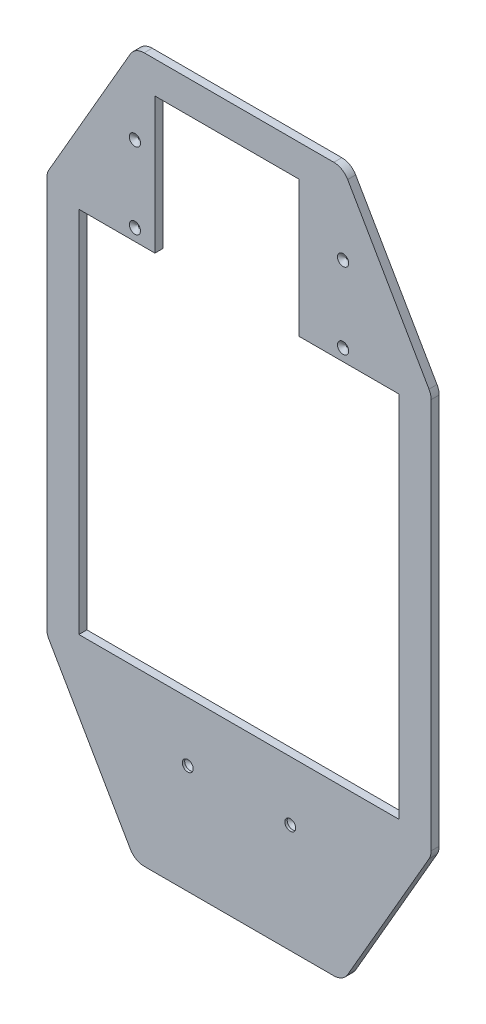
ISO-10303-21;
HEADER;
FILE_DESCRIPTION(('STEP AP214'),'2;1');
FILE_NAME('part.step','',(''),(''),'','','');
FILE_SCHEMA(('AUTOMOTIVE_DESIGN { 1 0 10303 214 1 1 1 1 }'));
ENDSEC;
DATA;
#1=APPLICATION_CONTEXT('core data for automotive mechanical design processes');
#2=APPLICATION_PROTOCOL_DEFINITION('international standard','automotive_design',2000,#1);
#3=PRODUCT_CONTEXT('',#1,'mechanical');
#4=PRODUCT('Part','Part','',(#3));
#5=PRODUCT_RELATED_PRODUCT_CATEGORY('part','',(#4));
#6=PRODUCT_DEFINITION_FORMATION('','',#4);
#7=PRODUCT_DEFINITION_CONTEXT('part definition',#1,'design');
#8=PRODUCT_DEFINITION('design','',#6,#7);
#9=PRODUCT_DEFINITION_SHAPE('','',#8);
#10=(LENGTH_UNIT() NAMED_UNIT(*) SI_UNIT(.MILLI.,.METRE.));
#11=(NAMED_UNIT(*) PLANE_ANGLE_UNIT() SI_UNIT($,.RADIAN.));
#12=(NAMED_UNIT(*) SI_UNIT($,.STERADIAN.) SOLID_ANGLE_UNIT());
#13=UNCERTAINTY_MEASURE_WITH_UNIT(LENGTH_MEASURE(1.E-05),#10,'distance_accuracy_value','');
#14=(GEOMETRIC_REPRESENTATION_CONTEXT(3) GLOBAL_UNCERTAINTY_ASSIGNED_CONTEXT((#13)) GLOBAL_UNIT_ASSIGNED_CONTEXT((#10,
#11,#12)) REPRESENTATION_CONTEXT('',''));
#15=CARTESIAN_POINT('',(0.,0.,0.));
#16=DIRECTION('',(0.,0.,1.));
#17=DIRECTION('',(1.,0.,0.));
#18=AXIS2_PLACEMENT_3D('',#15,#16,#17);
#19=CARTESIAN_POINT('',(0.,0.,4.));
#20=DIRECTION('',(0.,0.,1.));
#21=DIRECTION('',(1.,0.,0.));
#22=AXIS2_PLACEMENT_3D('',#19,#20,#21);
#23=PLANE('',#22);
#24=DIRECTION('',(0.,1.,0.));
#25=VECTOR('',#24,1.);
#26=CARTESIAN_POINT('',(99.9999999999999,116.666666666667,4.));
#27=LINE('',#26,#25);
#28=CARTESIAN_POINT('',(100.,-115.,4.));
#29=VERTEX_POINT('',#28);
#30=CARTESIAN_POINT('',(99.9999999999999,115.,4.));
#31=VERTEX_POINT('',#30);
#32=EDGE_CURVE('E285',#29,#31,#27,.T.);
#33=ORIENTED_EDGE('',*,*,#32,.T.);
#34=DIRECTION('',(-1.,0.,0.));
#35=VECTOR('',#34,1.);
#36=CARTESIAN_POINT('',(-37.5,115.,4.));
#37=LINE('',#36,#35);
#38=CARTESIAN_POINT('',(37.5,115.,4.));
#39=VERTEX_POINT('',#38);
#40=EDGE_CURVE('E291',#31,#39,#37,.T.);
#41=ORIENTED_EDGE('',*,*,#40,.T.);
#42=DIRECTION('',(0.,-1.,0.));
#43=VECTOR('',#42,1.);
#44=CARTESIAN_POINT('',(37.5,200.,4.));
#45=LINE('',#44,#43);
#46=CARTESIAN_POINT('',(37.5,200.,4.));
#47=VERTEX_POINT('',#46);
#48=EDGE_CURVE('E964',#47,#39,#45,.T.);
#49=ORIENTED_EDGE('',*,*,#48,.F.);
#50=DIRECTION('',(-1.,0.,0.));
#51=VECTOR('',#50,1.);
#52=CARTESIAN_POINT('',(47.6609802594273,200.,4.));
#53=LINE('',#52,#51);
#54=CARTESIAN_POINT('',(-52.5,200.,4.));
#55=VERTEX_POINT('',#54);
#56=EDGE_CURVE('E64',#47,#55,#53,.T.);
#57=ORIENTED_EDGE('',*,*,#56,.T.);
#58=DIRECTION('',(0.,1.,0.));
#59=VECTOR('',#58,1.);
#60=CARTESIAN_POINT('',(-52.5,200.,4.));
#61=LINE('',#60,#59);
#62=CARTESIAN_POINT('',(-52.5,115.,4.));
#63=VERTEX_POINT('',#62);
#64=EDGE_CURVE('E958',#63,#55,#61,.T.);
#65=ORIENTED_EDGE('',*,*,#64,.F.);
#66=CARTESIAN_POINT('',(-100.,115.,4.));
#67=VERTEX_POINT('',#66);
#68=EDGE_CURVE('E297',#63,#67,#37,.T.);
#69=ORIENTED_EDGE('',*,*,#68,.T.);
#70=DIRECTION('',(0.,-1.,0.));
#71=VECTOR('',#70,1.);
#72=CARTESIAN_POINT('',(-100.,116.666666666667,4.));
#73=LINE('',#72,#71);
#74=CARTESIAN_POINT('',(-100.,-115.,4.));
#75=VERTEX_POINT('',#74);
#76=EDGE_CURVE('E952',#67,#75,#73,.T.);
#77=ORIENTED_EDGE('',*,*,#76,.T.);
#78=DIRECTION('',(-1.,0.,0.));
#79=VECTOR('',#78,1.);
#80=CARTESIAN_POINT('',(-37.5,-115.,4.));
#81=LINE('',#80,#79);
#82=EDGE_CURVE('E295',#29,#75,#81,.T.);
#83=ORIENTED_EDGE('',*,*,#82,.F.);
#84=EDGE_LOOP('',(#33,#41,#49,#57,#65,#69,#77,#83));
#85=FACE_BOUND('',#84,.T.);
#86=DIRECTION('',(-0.499999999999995,-0.866025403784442,0.));
#87=VECTOR('',#86,1.);
#88=CARTESIAN_POINT('',(77.1058439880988,-199.,4.));
#89=LINE('',#88,#87);
#90=CARTESIAN_POINT('',(118.660254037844,-127.025650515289,4.));
#91=VERTEX_POINT('',#90);
#92=CARTESIAN_POINT('',(67.8682396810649,-215.,4.));
#93=VERTEX_POINT('',#92);
#94=EDGE_CURVE('E261',#91,#93,#89,.T.);
#95=ORIENTED_EDGE('',*,*,#94,.T.);
#96=CARTESIAN_POINT('',(59.2079856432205,-210.,4.));
#97=DIRECTION('',(0.,0.,1.));
#98=DIRECTION('',(1.,0.,0.));
#99=AXIS2_PLACEMENT_3D('',#96,#97,#98);
#100=CIRCLE('',#99,10.);
#101=CARTESIAN_POINT('',(59.2079856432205,-220.,4.));
#102=VERTEX_POINT('',#101);
#103=EDGE_CURVE('E13',#102,#93,#100,.T.);
#104=ORIENTED_EDGE('',*,*,#103,.F.);
#105=DIRECTION('',(1.,0.,0.));
#106=VECTOR('',#105,1.);
#107=CARTESIAN_POINT('',(0.,-220.,4.));
#108=LINE('',#107,#106);
#109=CARTESIAN_POINT('',(-59.2079856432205,-220.,4.));
#110=VERTEX_POINT('',#109);
#111=EDGE_CURVE('E49',#110,#102,#108,.T.);
#112=ORIENTED_EDGE('',*,*,#111,.F.);
#113=CARTESIAN_POINT('',(-59.2079856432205,-210.,4.));
#114=DIRECTION('',(0.,0.,1.));
#115=DIRECTION('',(1.,0.,0.));
#116=AXIS2_PLACEMENT_3D('',#113,#114,#115);
#117=CIRCLE('',#116,10.);
#118=CARTESIAN_POINT('',(-67.8682396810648,-215.,4.));
#119=VERTEX_POINT('',#118);
#120=EDGE_CURVE('E244',#119,#110,#117,.T.);
#121=ORIENTED_EDGE('',*,*,#120,.F.);
#122=DIRECTION('',(-0.499999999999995,0.866025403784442,0.));
#123=VECTOR('',#122,1.);
#124=CARTESIAN_POINT('',(-77.1058439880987,-199.,4.));
#125=LINE('',#124,#123);
#126=CARTESIAN_POINT('',(-118.660254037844,-127.025650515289,4.));
#127=VERTEX_POINT('',#126);
#128=EDGE_CURVE('E377',#119,#127,#125,.T.);
#129=ORIENTED_EDGE('',*,*,#128,.T.);
#130=CARTESIAN_POINT('',(-110.,-122.025650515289,4.));
#131=DIRECTION('',(0.,0.,-1.));
#132=DIRECTION('',(-1.,0.,0.));
#133=AXIS2_PLACEMENT_3D('',#130,#131,#132);
#134=CIRCLE('',#133,9.99999999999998);
#135=CARTESIAN_POINT('',(-120.,-122.025650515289,4.));
#136=VERTEX_POINT('',#135);
#137=EDGE_CURVE('E379',#127,#136,#134,.T.);
#138=ORIENTED_EDGE('',*,*,#137,.T.);
#139=DIRECTION('',(0.,1.,0.));
#140=VECTOR('',#139,1.);
#141=CARTESIAN_POINT('',(-120.,-122.025650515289,4.));
#142=LINE('',#141,#140);
#143=CARTESIAN_POINT('',(-120.,122.025650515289,4.));
#144=VERTEX_POINT('',#143);
#145=EDGE_CURVE('E381',#136,#144,#142,.T.);
#146=ORIENTED_EDGE('',*,*,#145,.T.);
#147=CARTESIAN_POINT('',(-110.,122.025650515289,4.));
#148=DIRECTION('',(0.,0.,-1.));
#149=DIRECTION('',(-1.,0.,0.));
#150=AXIS2_PLACEMENT_3D('',#147,#148,#149);
#151=CIRCLE('',#150,10.);
#152=CARTESIAN_POINT('',(-118.660254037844,127.025650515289,4.));
#153=VERTEX_POINT('',#152);
#154=EDGE_CURVE('E374',#144,#153,#151,.T.);
#155=ORIENTED_EDGE('',*,*,#154,.T.);
#156=DIRECTION('',(0.500000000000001,0.866025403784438,0.));
#157=VECTOR('',#156,1.);
#158=CARTESIAN_POINT('',(-118.660254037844,127.025650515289,4.));
#159=LINE('',#158,#157);
#160=CARTESIAN_POINT('',(-67.8682396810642,215.,4.));
#161=VERTEX_POINT('',#160);
#162=EDGE_CURVE('E241',#153,#161,#159,.T.);
#163=ORIENTED_EDGE('',*,*,#162,.T.);
#164=CARTESIAN_POINT('',(-59.2079856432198,210.,4.));
#165=DIRECTION('',(0.,0.,1.));
#166=DIRECTION('',(1.,0.,0.));
#167=AXIS2_PLACEMENT_3D('',#164,#165,#166);
#168=CIRCLE('',#167,10.);
#169=CARTESIAN_POINT('',(-59.2079856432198,220.,4.));
#170=VERTEX_POINT('',#169);
#171=EDGE_CURVE('E227',#170,#161,#168,.T.);
#172=ORIENTED_EDGE('',*,*,#171,.F.);
#173=DIRECTION('',(-1.,0.,0.));
#174=VECTOR('',#173,1.);
#175=CARTESIAN_POINT('',(0.,220.,4.));
#176=LINE('',#175,#174);
#177=CARTESIAN_POINT('',(59.2079856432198,220.,4.));
#178=VERTEX_POINT('',#177);
#179=EDGE_CURVE('E232',#178,#170,#176,.T.);
#180=ORIENTED_EDGE('',*,*,#179,.F.);
#181=CARTESIAN_POINT('',(59.2079856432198,210.,4.));
#182=DIRECTION('',(0.,0.,1.));
#183=DIRECTION('',(1.,0.,0.));
#184=AXIS2_PLACEMENT_3D('',#181,#182,#183);
#185=CIRCLE('',#184,10.);
#186=CARTESIAN_POINT('',(67.8682396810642,215.,4.));
#187=VERTEX_POINT('',#186);
#188=EDGE_CURVE('E242',#187,#178,#185,.T.);
#189=ORIENTED_EDGE('',*,*,#188,.F.);
#190=DIRECTION('',(0.500000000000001,-0.866025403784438,0.));
#191=VECTOR('',#190,1.);
#192=CARTESIAN_POINT('',(118.660254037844,127.025650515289,4.));
#193=LINE('',#192,#191);
#194=CARTESIAN_POINT('',(118.660254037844,127.025650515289,4.));
#195=VERTEX_POINT('',#194);
#196=EDGE_CURVE('E383',#187,#195,#193,.T.);
#197=ORIENTED_EDGE('',*,*,#196,.T.);
#198=CARTESIAN_POINT('',(110.,122.025650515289,4.));
#199=DIRECTION('',(0.,0.,-1.));
#200=DIRECTION('',(1.,0.,0.));
#201=AXIS2_PLACEMENT_3D('',#198,#199,#200);
#202=CIRCLE('',#201,9.99999999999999);
#203=CARTESIAN_POINT('',(120.,122.025650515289,4.));
#204=VERTEX_POINT('',#203);
#205=EDGE_CURVE('E385',#195,#204,#202,.T.);
#206=ORIENTED_EDGE('',*,*,#205,.T.);
#207=DIRECTION('',(0.,-1.,0.));
#208=VECTOR('',#207,1.);
#209=CARTESIAN_POINT('',(120.,-122.025650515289,4.));
#210=LINE('',#209,#208);
#211=CARTESIAN_POINT('',(120.,-122.025650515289,4.));
#212=VERTEX_POINT('',#211);
#213=EDGE_CURVE('E387',#204,#212,#210,.T.);
#214=ORIENTED_EDGE('',*,*,#213,.T.);
#215=CARTESIAN_POINT('',(110.,-122.025650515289,4.));
#216=DIRECTION('',(0.,0.,-1.));
#217=DIRECTION('',(1.,0.,0.));
#218=AXIS2_PLACEMENT_3D('',#215,#216,#217);
#219=CIRCLE('',#218,9.99999999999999);
#220=EDGE_CURVE('E389',#212,#91,#219,.T.);
#221=ORIENTED_EDGE('',*,*,#220,.T.);
#222=EDGE_LOOP('',(#95,#104,#112,#121,#129,#138,#146,#155,#163,#172,#180,#189,#197,#206,#214,#221));
#223=FACE_BOUND('',#222,.T.);
#224=ADVANCED_FACE('F41',(#85,#223),#23,.F.);
#225=CARTESIAN_POINT('',(-37.5,115.,-10.));
#226=DIRECTION('',(0.,-1.,0.));
#227=DIRECTION('',(0.,0.,-1.));
#228=AXIS2_PLACEMENT_3D('',#225,#226,#227);
#229=PLANE('',#228);
#230=ORIENTED_EDGE('',*,*,#40,.F.);
#231=DIRECTION('',(0.,0.,1.));
#232=VECTOR('',#231,1.);
#233=CARTESIAN_POINT('',(100.,115.,-10.));
#234=LINE('',#233,#232);
#235=CARTESIAN_POINT('',(99.9999999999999,115.,9.));
#236=VERTEX_POINT('',#235);
#237=EDGE_CURVE('E395',#31,#236,#234,.T.);
#238=ORIENTED_EDGE('',*,*,#237,.T.);
#239=DIRECTION('',(-1.,0.,0.));
#240=VECTOR('',#239,1.);
#241=CARTESIAN_POINT('',(-37.5,115.,9.));
#242=LINE('',#241,#240);
#243=CARTESIAN_POINT('',(37.5,115.,9.));
#244=VERTEX_POINT('',#243);
#245=EDGE_CURVE('E307',#236,#244,#242,.T.);
#246=ORIENTED_EDGE('',*,*,#245,.T.);
#247=DIRECTION('',(0.,0.,1.));
#248=VECTOR('',#247,1.);
#249=CARTESIAN_POINT('',(37.5,115.,-10.));
#250=LINE('',#249,#248);
#251=EDGE_CURVE('E394',#39,#244,#250,.T.);
#252=ORIENTED_EDGE('',*,*,#251,.F.);
#253=EDGE_LOOP('',(#230,#238,#246,#252));
#254=FACE_BOUND('',#253,.T.);
#255=ADVANCED_FACE('F487',(#254),#229,.T.);
#256=CARTESIAN_POINT('',(-118.660254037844,127.025650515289,30.));
#257=DIRECTION('',(0.866025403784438,-0.500000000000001,0.));
#258=DIRECTION('',(0.500000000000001,0.866025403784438,0.));
#259=AXIS2_PLACEMENT_3D('',#256,#257,#258);
#260=PLANE('',#259);
#261=DIRECTION('',(0.,0.,-1.));
#262=VECTOR('',#261,1.);
#263=CARTESIAN_POINT('',(-67.8682396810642,215.,30.));
#264=LINE('',#263,#262);
#265=CARTESIAN_POINT('',(-67.8682396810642,215.,9.));
#266=VERTEX_POINT('',#265);
#267=EDGE_CURVE('E229',#266,#161,#264,.T.);
#268=ORIENTED_EDGE('',*,*,#267,.T.);
#269=ORIENTED_EDGE('',*,*,#162,.F.);
#270=DIRECTION('',(0.,0.,-1.));
#271=VECTOR('',#270,1.);
#272=CARTESIAN_POINT('',(-118.660254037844,127.025650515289,30.));
#273=LINE('',#272,#271);
#274=CARTESIAN_POINT('',(-118.660254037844,127.025650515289,9.));
#275=VERTEX_POINT('',#274);
#276=EDGE_CURVE('E406',#275,#153,#273,.T.);
#277=ORIENTED_EDGE('',*,*,#276,.F.);
#278=DIRECTION('',(-0.500000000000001,-0.866025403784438,0.));
#279=VECTOR('',#278,1.);
#280=CARTESIAN_POINT('',(-118.660254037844,127.025650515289,9.));
#281=LINE('',#280,#279);
#282=EDGE_CURVE('E359',#266,#275,#281,.T.);
#283=ORIENTED_EDGE('',*,*,#282,.F.);
#284=EDGE_LOOP('',(#268,#269,#277,#283));
#285=FACE_BOUND('',#284,.T.);
#286=ADVANCED_FACE('F459',(#285),#260,.F.);
#287=CARTESIAN_POINT('',(-110.,-122.025650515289,30.));
#288=DIRECTION('',(0.,0.,-1.));
#289=DIRECTION('',(-1.,0.,0.));
#290=AXIS2_PLACEMENT_3D('',#287,#288,#289);
#291=CYLINDRICAL_SURFACE('',#290,9.99999999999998);
#292=CARTESIAN_POINT('',(-110.,-122.025650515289,9.));
#293=DIRECTION('',(0.,0.,1.));
#294=DIRECTION('',(1.,0.,0.));
#295=AXIS2_PLACEMENT_3D('',#292,#293,#294);
#296=CIRCLE('',#295,9.99999999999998);
#297=CARTESIAN_POINT('',(-120.,-122.025650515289,9.));
#298=VERTEX_POINT('',#297);
#299=CARTESIAN_POINT('',(-118.660254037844,-127.025650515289,9.));
#300=VERTEX_POINT('',#299);
#301=EDGE_CURVE('E351',#298,#300,#296,.T.);
#302=ORIENTED_EDGE('',*,*,#301,.F.);
#303=DIRECTION('',(0.,0.,-1.));
#304=VECTOR('',#303,1.);
#305=CARTESIAN_POINT('',(-120.,-122.025650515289,30.));
#306=LINE('',#305,#304);
#307=EDGE_CURVE('E400',#298,#136,#306,.T.);
#308=ORIENTED_EDGE('',*,*,#307,.T.);
#309=ORIENTED_EDGE('',*,*,#137,.F.);
#310=DIRECTION('',(0.,0.,-1.));
#311=VECTOR('',#310,1.);
#312=CARTESIAN_POINT('',(-118.660254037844,-127.025650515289,30.));
#313=LINE('',#312,#311);
#314=EDGE_CURVE('E276',#300,#127,#313,.T.);
#315=ORIENTED_EDGE('',*,*,#314,.F.);
#316=EDGE_LOOP('',(#302,#308,#309,#315));
#317=FACE_BOUND('',#316,.T.);
#318=ADVANCED_FACE('F43',(#317),#291,.T.);
#319=CARTESIAN_POINT('',(-118.660254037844,-127.025650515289,30.));
#320=DIRECTION('',(0.866025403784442,0.499999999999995,0.));
#321=DIRECTION('',(-0.499999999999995,0.866025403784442,0.));
#322=AXIS2_PLACEMENT_3D('',#319,#320,#321);
#323=PLANE('',#322);
#324=ORIENTED_EDGE('',*,*,#128,.F.);
#325=DIRECTION('',(0.,0.,-1.));
#326=VECTOR('',#325,1.);
#327=CARTESIAN_POINT('',(-67.8682396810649,-215.,30.));
#328=LINE('',#327,#326);
#329=CARTESIAN_POINT('',(-67.8682396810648,-215.,9.));
#330=VERTEX_POINT('',#329);
#331=EDGE_CURVE('E269',#330,#119,#328,.T.);
#332=ORIENTED_EDGE('',*,*,#331,.F.);
#333=DIRECTION('',(0.499999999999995,-0.866025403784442,0.));
#334=VECTOR('',#333,1.);
#335=CARTESIAN_POINT('',(-118.660254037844,-127.025650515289,9.));
#336=LINE('',#335,#334);
#337=EDGE_CURVE('E349',#300,#330,#336,.T.);
#338=ORIENTED_EDGE('',*,*,#337,.F.);
#339=ORIENTED_EDGE('',*,*,#314,.T.);
#340=EDGE_LOOP('',(#324,#332,#338,#339));
#341=FACE_BOUND('',#340,.T.);
#342=ADVANCED_FACE('F443',(#341),#323,.F.);
#343=CARTESIAN_POINT('',(-110.,122.025650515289,30.));
#344=DIRECTION('',(0.,0.,-1.));
#345=DIRECTION('',(-1.,0.,0.));
#346=AXIS2_PLACEMENT_3D('',#343,#344,#345);
#347=CYLINDRICAL_SURFACE('',#346,10.);
#348=CARTESIAN_POINT('',(-110.,122.025650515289,9.));
#349=DIRECTION('',(0.,0.,1.));
#350=DIRECTION('',(1.,0.,0.));
#351=AXIS2_PLACEMENT_3D('',#348,#349,#350);
#352=CIRCLE('',#351,10.);
#353=CARTESIAN_POINT('',(-120.,122.025650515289,9.));
#354=VERTEX_POINT('',#353);
#355=EDGE_CURVE('E357',#275,#354,#352,.T.);
#356=ORIENTED_EDGE('',*,*,#355,.F.);
#357=ORIENTED_EDGE('',*,*,#276,.T.);
#358=ORIENTED_EDGE('',*,*,#154,.F.);
#359=DIRECTION('',(0.,0.,-1.));
#360=VECTOR('',#359,1.);
#361=CARTESIAN_POINT('',(-120.,122.025650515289,30.));
#362=LINE('',#361,#360);
#363=EDGE_CURVE('E403',#354,#144,#362,.T.);
#364=ORIENTED_EDGE('',*,*,#363,.F.);
#365=EDGE_LOOP('',(#356,#357,#358,#364));
#366=FACE_BOUND('',#365,.T.);
#367=ADVANCED_FACE('F456',(#366),#347,.T.);
#368=CARTESIAN_POINT('',(-120.,122.025650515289,30.));
#369=DIRECTION('',(1.,0.,0.));
#370=DIRECTION('',(0.,1.,0.));
#371=AXIS2_PLACEMENT_3D('',#368,#369,#370);
#372=PLANE('',#371);
#373=DIRECTION('',(0.,-1.,0.));
#374=VECTOR('',#373,1.);
#375=CARTESIAN_POINT('',(-120.,122.025650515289,9.));
#376=LINE('',#375,#374);
#377=EDGE_CURVE('E355',#354,#298,#376,.T.);
#378=ORIENTED_EDGE('',*,*,#377,.F.);
#379=ORIENTED_EDGE('',*,*,#363,.T.);
#380=ORIENTED_EDGE('',*,*,#145,.F.);
#381=ORIENTED_EDGE('',*,*,#307,.F.);
#382=EDGE_LOOP('',(#378,#379,#380,#381));
#383=FACE_BOUND('',#382,.T.);
#384=ADVANCED_FACE('F450',(#383),#372,.F.);
#385=CARTESIAN_POINT('',(-59.2079856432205,-210.,30.));
#386=DIRECTION('',(0.,0.,-1.));
#387=DIRECTION('',(-1.,0.,0.));
#388=AXIS2_PLACEMENT_3D('',#385,#386,#387);
#389=CYLINDRICAL_SURFACE('',#388,10.);
#390=CARTESIAN_POINT('',(-59.2079856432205,-210.,9.));
#391=DIRECTION('',(0.,0.,1.));
#392=DIRECTION('',(1.,0.,0.));
#393=AXIS2_PLACEMENT_3D('',#390,#391,#392);
#394=CIRCLE('',#393,10.);
#395=CARTESIAN_POINT('',(-59.2079856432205,-220.,9.));
#396=VERTEX_POINT('',#395);
#397=EDGE_CURVE('E347',#330,#396,#394,.T.);
#398=ORIENTED_EDGE('',*,*,#397,.F.);
#399=ORIENTED_EDGE('',*,*,#331,.T.);
#400=ORIENTED_EDGE('',*,*,#120,.T.);
#401=DIRECTION('',(0.,0.,-1.));
#402=VECTOR('',#401,1.);
#403=CARTESIAN_POINT('',(-59.2079856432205,-220.,30.));
#404=LINE('',#403,#402);
#405=EDGE_CURVE('E258',#396,#110,#404,.T.);
#406=ORIENTED_EDGE('',*,*,#405,.F.);
#407=EDGE_LOOP('',(#398,#399,#400,#406));
#408=FACE_BOUND('',#407,.T.);
#409=ADVANCED_FACE('F436',(#408),#389,.T.);
#410=CARTESIAN_POINT('',(59.2079856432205,-220.,30.));
#411=DIRECTION('',(0.,1.,0.));
#412=DIRECTION('',(0.,0.,1.));
#413=AXIS2_PLACEMENT_3D('',#410,#411,#412);
#414=PLANE('',#413);
#415=DIRECTION('',(1.,0.,0.));
#416=VECTOR('',#415,1.);
#417=CARTESIAN_POINT('',(59.2079856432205,-220.,9.));
#418=LINE('',#417,#416);
#419=CARTESIAN_POINT('',(59.2079856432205,-220.,9.));
#420=VERTEX_POINT('',#419);
#421=EDGE_CURVE('E345',#396,#420,#418,.T.);
#422=ORIENTED_EDGE('',*,*,#421,.F.);
#423=ORIENTED_EDGE('',*,*,#405,.T.);
#424=ORIENTED_EDGE('',*,*,#111,.T.);
#425=DIRECTION('',(0.,0.,-1.));
#426=VECTOR('',#425,1.);
#427=CARTESIAN_POINT('',(59.2079856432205,-220.,30.));
#428=LINE('',#427,#426);
#429=EDGE_CURVE('E256',#420,#102,#428,.T.);
#430=ORIENTED_EDGE('',*,*,#429,.F.);
#431=EDGE_LOOP('',(#422,#423,#424,#430));
#432=FACE_BOUND('',#431,.T.);
#433=ADVANCED_FACE('F255',(#432),#414,.F.);
#434=CARTESIAN_POINT('',(59.2079856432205,-210.,30.));
#435=DIRECTION('',(0.,0.,-1.));
#436=DIRECTION('',(-1.,0.,0.));
#437=AXIS2_PLACEMENT_3D('',#434,#435,#436);
#438=CYLINDRICAL_SURFACE('',#437,10.);
#439=CARTESIAN_POINT('',(59.2079856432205,-210.,9.));
#440=DIRECTION('',(0.,0.,1.));
#441=DIRECTION('',(1.,0.,0.));
#442=AXIS2_PLACEMENT_3D('',#439,#440,#441);
#443=CIRCLE('',#442,10.);
#444=CARTESIAN_POINT('',(67.8682396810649,-215.,9.));
#445=VERTEX_POINT('',#444);
#446=EDGE_CURVE('E267',#420,#445,#443,.T.);
#447=ORIENTED_EDGE('',*,*,#446,.F.);
#448=ORIENTED_EDGE('',*,*,#429,.T.);
#449=ORIENTED_EDGE('',*,*,#103,.T.);
#450=DIRECTION('',(0.,0.,-1.));
#451=VECTOR('',#450,1.);
#452=CARTESIAN_POINT('',(67.8682396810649,-215.,30.));
#453=LINE('',#452,#451);
#454=EDGE_CURVE('E266',#445,#93,#453,.T.);
#455=ORIENTED_EDGE('',*,*,#454,.F.);
#456=EDGE_LOOP('',(#447,#448,#449,#455));
#457=FACE_BOUND('',#456,.T.);
#458=ADVANCED_FACE('F265',(#457),#438,.T.);
#459=CARTESIAN_POINT('',(37.5,200.,-10.));
#460=DIRECTION('',(1.,0.,0.));
#461=DIRECTION('',(0.,1.,0.));
#462=AXIS2_PLACEMENT_3D('',#459,#460,#461);
#463=PLANE('',#462);
#464=DIRECTION('',(0.,0.,1.));
#465=VECTOR('',#464,1.);
#466=CARTESIAN_POINT('',(37.5,200.,30.));
#467=LINE('',#466,#465);
#468=CARTESIAN_POINT('',(37.5,200.,9.));
#469=VERTEX_POINT('',#468);
#470=EDGE_CURVE('E236',#47,#469,#467,.T.);
#471=ORIENTED_EDGE('',*,*,#470,.F.);
#472=ORIENTED_EDGE('',*,*,#48,.T.);
#473=ORIENTED_EDGE('',*,*,#251,.T.);
#474=DIRECTION('',(0.,-1.,0.));
#475=VECTOR('',#474,1.);
#476=CARTESIAN_POINT('',(37.5,200.,9.));
#477=LINE('',#476,#475);
#478=EDGE_CURVE('E313',#469,#244,#477,.T.);
#479=ORIENTED_EDGE('',*,*,#478,.F.);
#480=EDGE_LOOP('',(#471,#472,#473,#479));
#481=FACE_BOUND('',#480,.T.);
#482=ADVANCED_FACE('F535',(#481),#463,.F.);
#483=CARTESIAN_POINT('',(47.6609802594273,200.,30.));
#484=DIRECTION('',(0.,-1.,0.));
#485=DIRECTION('',(0.,0.,-1.));
#486=AXIS2_PLACEMENT_3D('',#483,#484,#485);
#487=PLANE('',#486);
#488=ORIENTED_EDGE('',*,*,#56,.F.);
#489=ORIENTED_EDGE('',*,*,#470,.T.);
#490=DIRECTION('',(-1.,0.,0.));
#491=VECTOR('',#490,1.);
#492=CARTESIAN_POINT('',(47.6609802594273,200.,9.));
#493=LINE('',#492,#491);
#494=CARTESIAN_POINT('',(-52.5,200.,8.99999999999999));
#495=VERTEX_POINT('',#494);
#496=EDGE_CURVE('E310',#469,#495,#493,.T.);
#497=ORIENTED_EDGE('',*,*,#496,.T.);
#498=DIRECTION('',(0.,0.,1.));
#499=VECTOR('',#498,1.);
#500=CARTESIAN_POINT('',(-52.5,200.,-86.3133825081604));
#501=LINE('',#500,#499);
#502=EDGE_CURVE('E364',#55,#495,#501,.T.);
#503=ORIENTED_EDGE('',*,*,#502,.F.);
#504=EDGE_LOOP('',(#488,#489,#497,#503));
#505=FACE_BOUND('',#504,.T.);
#506=ADVANCED_FACE('F538',(#505),#487,.T.);
#507=CARTESIAN_POINT('',(118.660254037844,127.025650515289,30.));
#508=DIRECTION('',(-0.866025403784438,-0.500000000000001,0.));
#509=DIRECTION('',(0.500000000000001,-0.866025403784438,0.));
#510=AXIS2_PLACEMENT_3D('',#507,#508,#509);
#511=PLANE('',#510);
#512=ORIENTED_EDGE('',*,*,#196,.F.);
#513=DIRECTION('',(0.,0.,-1.));
#514=VECTOR('',#513,1.);
#515=CARTESIAN_POINT('',(67.8682396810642,215.,30.));
#516=LINE('',#515,#514);
#517=CARTESIAN_POINT('',(67.8682396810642,215.,9.));
#518=VERTEX_POINT('',#517);
#519=EDGE_CURVE('E411',#518,#187,#516,.T.);
#520=ORIENTED_EDGE('',*,*,#519,.F.);
#521=DIRECTION('',(-0.500000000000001,0.866025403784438,0.));
#522=VECTOR('',#521,1.);
#523=CARTESIAN_POINT('',(118.660254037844,127.025650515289,9.));
#524=LINE('',#523,#522);
#525=CARTESIAN_POINT('',(118.660254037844,127.025650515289,9.));
#526=VERTEX_POINT('',#525);
#527=EDGE_CURVE('E342',#526,#518,#524,.T.);
#528=ORIENTED_EDGE('',*,*,#527,.F.);
#529=DIRECTION('',(0.,0.,-1.));
#530=VECTOR('',#529,1.);
#531=CARTESIAN_POINT('',(118.660254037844,127.025650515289,30.));
#532=LINE('',#531,#530);
#533=EDGE_CURVE('E413',#526,#195,#532,.T.);
#534=ORIENTED_EDGE('',*,*,#533,.T.);
#535=EDGE_LOOP('',(#512,#520,#528,#534));
#536=FACE_BOUND('',#535,.T.);
#537=ADVANCED_FACE('F469',(#536),#511,.F.);
#538=CARTESIAN_POINT('',(59.2079856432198,210.,30.));
#539=DIRECTION('',(0.,0.,-1.));
#540=DIRECTION('',(-1.,0.,0.));
#541=AXIS2_PLACEMENT_3D('',#538,#539,#540);
#542=CYLINDRICAL_SURFACE('',#541,10.);
#543=CARTESIAN_POINT('',(59.2079856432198,210.,9.));
#544=DIRECTION('',(0.,0.,1.));
#545=DIRECTION('',(1.,0.,0.));
#546=AXIS2_PLACEMENT_3D('',#543,#544,#545);
#547=CIRCLE('',#546,10.);
#548=CARTESIAN_POINT('',(59.2079856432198,220.,9.));
#549=VERTEX_POINT('',#548);
#550=EDGE_CURVE('E353',#518,#549,#547,.T.);
#551=ORIENTED_EDGE('',*,*,#550,.F.);
#552=ORIENTED_EDGE('',*,*,#519,.T.);
#553=ORIENTED_EDGE('',*,*,#188,.T.);
#554=DIRECTION('',(0.,0.,-1.));
#555=VECTOR('',#554,1.);
#556=CARTESIAN_POINT('',(59.2079856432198,220.,30.));
#557=LINE('',#556,#555);
#558=EDGE_CURVE('E56',#549,#178,#557,.T.);
#559=ORIENTED_EDGE('',*,*,#558,.F.);
#560=EDGE_LOOP('',(#551,#552,#553,#559));
#561=FACE_BOUND('',#560,.T.);
#562=ADVANCED_FACE('F462',(#561),#542,.T.);
#563=CARTESIAN_POINT('',(59.2079856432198,220.,30.));
#564=DIRECTION('',(0.,-1.,0.));
#565=DIRECTION('',(0.,0.,-1.));
#566=AXIS2_PLACEMENT_3D('',#563,#564,#565);
#567=PLANE('',#566);
#568=DIRECTION('',(-1.,0.,0.));
#569=VECTOR('',#568,1.);
#570=CARTESIAN_POINT('',(59.2079856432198,220.,9.));
#571=LINE('',#570,#569);
#572=CARTESIAN_POINT('',(-59.2079856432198,220.,9.));
#573=VERTEX_POINT('',#572);
#574=EDGE_CURVE('E362',#549,#573,#571,.T.);
#575=ORIENTED_EDGE('',*,*,#574,.F.);
#576=ORIENTED_EDGE('',*,*,#558,.T.);
#577=ORIENTED_EDGE('',*,*,#179,.T.);
#578=DIRECTION('',(0.,0.,-1.));
#579=VECTOR('',#578,1.);
#580=CARTESIAN_POINT('',(-59.2079856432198,220.,30.));
#581=LINE('',#580,#579);
#582=EDGE_CURVE('E223',#573,#170,#581,.T.);
#583=ORIENTED_EDGE('',*,*,#582,.F.);
#584=EDGE_LOOP('',(#575,#576,#577,#583));
#585=FACE_BOUND('',#584,.T.);
#586=ADVANCED_FACE('F233',(#585),#567,.F.);
#587=CARTESIAN_POINT('',(-59.2079856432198,210.,30.));
#588=DIRECTION('',(0.,0.,-1.));
#589=DIRECTION('',(-1.,0.,0.));
#590=AXIS2_PLACEMENT_3D('',#587,#588,#589);
#591=CYLINDRICAL_SURFACE('',#590,10.);
#592=CARTESIAN_POINT('',(-59.2079856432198,210.,9.));
#593=DIRECTION('',(0.,0.,1.));
#594=DIRECTION('',(1.,0.,0.));
#595=AXIS2_PLACEMENT_3D('',#592,#593,#594);
#596=CIRCLE('',#595,10.);
#597=EDGE_CURVE('E228',#573,#266,#596,.T.);
#598=ORIENTED_EDGE('',*,*,#597,.F.);
#599=ORIENTED_EDGE('',*,*,#582,.T.);
#600=ORIENTED_EDGE('',*,*,#171,.T.);
#601=ORIENTED_EDGE('',*,*,#267,.F.);
#602=EDGE_LOOP('',(#598,#599,#600,#601));
#603=FACE_BOUND('',#602,.T.);
#604=ADVANCED_FACE('F224',(#603),#591,.T.);
#605=CARTESIAN_POINT('',(99.9999999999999,116.666666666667,30.));
#606=DIRECTION('',(-1.,0.,0.));
#607=DIRECTION('',(0.,-1.,0.));
#608=AXIS2_PLACEMENT_3D('',#605,#606,#607);
#609=PLANE('',#608);
#610=ORIENTED_EDGE('',*,*,#32,.F.);
#611=DIRECTION('',(0.,0.,1.));
#612=VECTOR('',#611,1.);
#613=CARTESIAN_POINT('',(100.,-115.,-10.));
#614=LINE('',#613,#612);
#615=CARTESIAN_POINT('',(100.,-115.,9.));
#616=VERTEX_POINT('',#615);
#617=EDGE_CURVE('E392',#29,#616,#614,.T.);
#618=ORIENTED_EDGE('',*,*,#617,.T.);
#619=DIRECTION('',(0.,1.,0.));
#620=VECTOR('',#619,1.);
#621=CARTESIAN_POINT('',(99.9999999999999,116.666666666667,9.));
#622=LINE('',#621,#620);
#623=EDGE_CURVE('E319',#616,#236,#622,.T.);
#624=ORIENTED_EDGE('',*,*,#623,.T.);
#625=ORIENTED_EDGE('',*,*,#237,.F.);
#626=EDGE_LOOP('',(#610,#618,#624,#625));
#627=FACE_BOUND('',#626,.T.);
#628=ADVANCED_FACE('F548',(#627),#609,.T.);
#629=CARTESIAN_POINT('',(-100.,116.666666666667,30.));
#630=DIRECTION('',(1.,0.,0.));
#631=DIRECTION('',(0.,1.,0.));
#632=AXIS2_PLACEMENT_3D('',#629,#630,#631);
#633=PLANE('',#632);
#634=ORIENTED_EDGE('',*,*,#76,.F.);
#635=DIRECTION('',(0.,0.,-1.));
#636=VECTOR('',#635,1.);
#637=CARTESIAN_POINT('',(-100.,115.,30.));
#638=LINE('',#637,#636);
#639=CARTESIAN_POINT('',(-100.,115.,9.));
#640=VERTEX_POINT('',#639);
#641=EDGE_CURVE('E279',#640,#67,#638,.T.);
#642=ORIENTED_EDGE('',*,*,#641,.F.);
#643=DIRECTION('',(0.,-1.,0.));
#644=VECTOR('',#643,1.);
#645=CARTESIAN_POINT('',(-100.,116.666666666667,9.));
#646=LINE('',#645,#644);
#647=CARTESIAN_POINT('',(-100.,-115.,9.));
#648=VERTEX_POINT('',#647);
#649=EDGE_CURVE('E306',#640,#648,#646,.T.);
#650=ORIENTED_EDGE('',*,*,#649,.T.);
#651=DIRECTION('',(0.,0.,1.));
#652=VECTOR('',#651,1.);
#653=CARTESIAN_POINT('',(-100.,-115.,-10.));
#654=LINE('',#653,#652);
#655=EDGE_CURVE('E397',#75,#648,#654,.T.);
#656=ORIENTED_EDGE('',*,*,#655,.F.);
#657=EDGE_LOOP('',(#634,#642,#650,#656));
#658=FACE_BOUND('',#657,.T.);
#659=ADVANCED_FACE('F545',(#658),#633,.T.);
#660=CARTESIAN_POINT('',(118.660254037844,-127.025650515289,30.));
#661=DIRECTION('',(-0.866025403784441,0.499999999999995,0.));
#662=DIRECTION('',(-0.499999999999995,-0.866025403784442,0.));
#663=AXIS2_PLACEMENT_3D('',#660,#661,#662);
#664=PLANE('',#663);
#665=ORIENTED_EDGE('',*,*,#454,.T.);
#666=ORIENTED_EDGE('',*,*,#94,.F.);
#667=DIRECTION('',(0.,0.,-1.));
#668=VECTOR('',#667,1.);
#669=CARTESIAN_POINT('',(118.660254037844,-127.025650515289,30.));
#670=LINE('',#669,#668);
#671=CARTESIAN_POINT('',(118.660254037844,-127.025650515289,9.));
#672=VERTEX_POINT('',#671);
#673=EDGE_CURVE('E271',#672,#91,#670,.T.);
#674=ORIENTED_EDGE('',*,*,#673,.F.);
#675=DIRECTION('',(0.499999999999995,0.866025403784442,0.));
#676=VECTOR('',#675,1.);
#677=CARTESIAN_POINT('',(118.660254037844,-127.025650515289,9.));
#678=LINE('',#677,#676);
#679=EDGE_CURVE('E340',#445,#672,#678,.T.);
#680=ORIENTED_EDGE('',*,*,#679,.F.);
#681=EDGE_LOOP('',(#665,#666,#674,#680));
#682=FACE_BOUND('',#681,.T.);
#683=ADVANCED_FACE('F430',(#682),#664,.F.);
#684=CARTESIAN_POINT('',(110.,-122.025650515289,30.));
#685=DIRECTION('',(0.,0.,-1.));
#686=DIRECTION('',(-1.,0.,0.));
#687=AXIS2_PLACEMENT_3D('',#684,#685,#686);
#688=CYLINDRICAL_SURFACE('',#687,9.99999999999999);
#689=CARTESIAN_POINT('',(110.,-122.025650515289,9.));
#690=DIRECTION('',(0.,0.,1.));
#691=DIRECTION('',(1.,0.,0.));
#692=AXIS2_PLACEMENT_3D('',#689,#690,#691);
#693=CIRCLE('',#692,9.99999999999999);
#694=CARTESIAN_POINT('',(120.,-122.025650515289,9.));
#695=VERTEX_POINT('',#694);
#696=EDGE_CURVE('E338',#672,#695,#693,.T.);
#697=ORIENTED_EDGE('',*,*,#696,.F.);
#698=ORIENTED_EDGE('',*,*,#673,.T.);
#699=ORIENTED_EDGE('',*,*,#220,.F.);
#700=DIRECTION('',(0.,0.,-1.));
#701=VECTOR('',#700,1.);
#702=CARTESIAN_POINT('',(120.,-122.025650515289,30.));
#703=LINE('',#702,#701);
#704=EDGE_CURVE('E419',#695,#212,#703,.T.);
#705=ORIENTED_EDGE('',*,*,#704,.F.);
#706=EDGE_LOOP('',(#697,#698,#699,#705));
#707=FACE_BOUND('',#706,.T.);
#708=ADVANCED_FACE('F426',(#707),#688,.T.);
#709=CARTESIAN_POINT('',(120.,122.025650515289,30.));
#710=DIRECTION('',(-1.,0.,0.));
#711=DIRECTION('',(0.,-1.,0.));
#712=AXIS2_PLACEMENT_3D('',#709,#710,#711);
#713=PLANE('',#712);
#714=DIRECTION('',(0.,1.,0.));
#715=VECTOR('',#714,1.);
#716=CARTESIAN_POINT('',(120.,122.025650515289,9.));
#717=LINE('',#716,#715);
#718=CARTESIAN_POINT('',(120.,122.025650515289,9.));
#719=VERTEX_POINT('',#718);
#720=EDGE_CURVE('E336',#695,#719,#717,.T.);
#721=ORIENTED_EDGE('',*,*,#720,.F.);
#722=ORIENTED_EDGE('',*,*,#704,.T.);
#723=ORIENTED_EDGE('',*,*,#213,.F.);
#724=DIRECTION('',(0.,0.,-1.));
#725=VECTOR('',#724,1.);
#726=CARTESIAN_POINT('',(120.,122.025650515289,30.));
#727=LINE('',#726,#725);
#728=EDGE_CURVE('E416',#719,#204,#727,.T.);
#729=ORIENTED_EDGE('',*,*,#728,.F.);
#730=EDGE_LOOP('',(#721,#722,#723,#729));
#731=FACE_BOUND('',#730,.T.);
#732=ADVANCED_FACE('F476',(#731),#713,.F.);
#733=CARTESIAN_POINT('',(110.,122.025650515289,30.));
#734=DIRECTION('',(0.,0.,-1.));
#735=DIRECTION('',(-1.,0.,0.));
#736=AXIS2_PLACEMENT_3D('',#733,#734,#735);
#737=CYLINDRICAL_SURFACE('',#736,10.);
#738=CARTESIAN_POINT('',(110.,122.025650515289,9.));
#739=DIRECTION('',(0.,0.,1.));
#740=DIRECTION('',(1.,0.,0.));
#741=AXIS2_PLACEMENT_3D('',#738,#739,#740);
#742=CIRCLE('',#741,10.);
#743=EDGE_CURVE('E334',#719,#526,#742,.T.);
#744=ORIENTED_EDGE('',*,*,#743,.F.);
#745=ORIENTED_EDGE('',*,*,#728,.T.);
#746=ORIENTED_EDGE('',*,*,#205,.F.);
#747=ORIENTED_EDGE('',*,*,#533,.F.);
#748=EDGE_LOOP('',(#744,#745,#746,#747));
#749=FACE_BOUND('',#748,.T.);
#750=ADVANCED_FACE('F472',(#749),#737,.T.);
#751=ORIENTED_EDGE('',*,*,#68,.F.);
#752=DIRECTION('',(0.,0.,1.));
#753=VECTOR('',#752,1.);
#754=CARTESIAN_POINT('',(-52.5,115.,-86.3133825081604));
#755=LINE('',#754,#753);
#756=CARTESIAN_POINT('',(-52.5,115.,8.99999999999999));
#757=VERTEX_POINT('',#756);
#758=EDGE_CURVE('E365',#63,#757,#755,.T.);
#759=ORIENTED_EDGE('',*,*,#758,.T.);
#760=EDGE_CURVE('E303',#757,#640,#242,.T.);
#761=ORIENTED_EDGE('',*,*,#760,.T.);
#762=ORIENTED_EDGE('',*,*,#641,.T.);
#763=EDGE_LOOP('',(#751,#759,#761,#762));
#764=FACE_BOUND('',#763,.T.);
#765=ADVANCED_FACE('F483',(#764),#229,.T.);
#766=CARTESIAN_POINT('',(-37.5,-115.,-10.));
#767=DIRECTION('',(0.,-1.,0.));
#768=DIRECTION('',(0.,0.,-1.));
#769=AXIS2_PLACEMENT_3D('',#766,#767,#768);
#770=PLANE('',#769);
#771=ORIENTED_EDGE('',*,*,#617,.F.);
#772=ORIENTED_EDGE('',*,*,#82,.T.);
#773=ORIENTED_EDGE('',*,*,#655,.T.);
#774=DIRECTION('',(-1.,0.,0.));
#775=VECTOR('',#774,1.);
#776=CARTESIAN_POINT('',(-37.5,-115.,9.));
#777=LINE('',#776,#775);
#778=EDGE_CURVE('E316',#616,#648,#777,.T.);
#779=ORIENTED_EDGE('',*,*,#778,.F.);
#780=EDGE_LOOP('',(#771,#772,#773,#779));
#781=FACE_BOUND('',#780,.T.);
#782=ADVANCED_FACE('F502',(#781),#770,.F.);
#783=CARTESIAN_POINT('',(-52.5,200.,-86.3133825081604));
#784=DIRECTION('',(-1.,0.,0.));
#785=DIRECTION('',(0.,-1.,0.));
#786=AXIS2_PLACEMENT_3D('',#783,#784,#785);
#787=PLANE('',#786);
#788=ORIENTED_EDGE('',*,*,#758,.F.);
#789=ORIENTED_EDGE('',*,*,#64,.T.);
#790=ORIENTED_EDGE('',*,*,#502,.T.);
#791=DIRECTION('',(0.,1.,0.));
#792=VECTOR('',#791,1.);
#793=CARTESIAN_POINT('',(-52.5,200.,8.99999999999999));
#794=LINE('',#793,#792);
#795=EDGE_CURVE('E289',#757,#495,#794,.T.);
#796=ORIENTED_EDGE('',*,*,#795,.F.);
#797=EDGE_LOOP('',(#788,#789,#790,#796));
#798=FACE_BOUND('',#797,.T.);
#799=ADVANCED_FACE('F498',(#798),#787,.F.);
#800=CARTESIAN_POINT('',(110.,122.025650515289,9.));
#801=DIRECTION('',(0.,0.,1.));
#802=DIRECTION('',(1.,0.,0.));
#803=AXIS2_PLACEMENT_3D('',#800,#801,#802);
#804=PLANE('',#803);
#805=CARTESIAN_POINT('',(-65.,170.,9.));
#806=DIRECTION('',(0.,0.,1.));
#807=DIRECTION('',(1.,0.,0.));
#808=AXIS2_PLACEMENT_3D('',#805,#806,#807);
#809=CIRCLE('',#808,3.5);
#810=CARTESIAN_POINT('',(-61.5,170.,9.));
#811=VERTEX_POINT('',#810);
#812=EDGE_CURVE('E331',#811,#811,#809,.F.);
#813=ORIENTED_EDGE('',*,*,#812,.T.);
#814=EDGE_LOOP('',(#813));
#815=FACE_BOUND('',#814,.T.);
#816=CARTESIAN_POINT('',(-65.,122.5,9.));
#817=DIRECTION('',(0.,0.,1.));
#818=DIRECTION('',(1.,0.,0.));
#819=AXIS2_PLACEMENT_3D('',#816,#817,#818);
#820=CIRCLE('',#819,3.5);
#821=CARTESIAN_POINT('',(-61.5,122.5,9.));
#822=VERTEX_POINT('',#821);
#823=EDGE_CURVE('E328',#822,#822,#820,.F.);
#824=ORIENTED_EDGE('',*,*,#823,.T.);
#825=EDGE_LOOP('',(#824));
#826=FACE_BOUND('',#825,.T.);
#827=CARTESIAN_POINT('',(65.,170.,9.));
#828=DIRECTION('',(0.,0.,1.));
#829=DIRECTION('',(1.,0.,0.));
#830=AXIS2_PLACEMENT_3D('',#827,#828,#829);
#831=CIRCLE('',#830,3.5);
#832=CARTESIAN_POINT('',(68.5,170.,9.));
#833=VERTEX_POINT('',#832);
#834=EDGE_CURVE('E325',#833,#833,#831,.F.);
#835=ORIENTED_EDGE('',*,*,#834,.T.);
#836=EDGE_LOOP('',(#835));
#837=FACE_BOUND('',#836,.T.);
#838=CARTESIAN_POINT('',(65.,122.5,9.));
#839=DIRECTION('',(0.,0.,1.));
#840=DIRECTION('',(1.,0.,0.));
#841=AXIS2_PLACEMENT_3D('',#838,#839,#840);
#842=CIRCLE('',#841,3.5);
#843=CARTESIAN_POINT('',(68.5,122.5,9.));
#844=VERTEX_POINT('',#843);
#845=EDGE_CURVE('E322',#844,#844,#842,.F.);
#846=ORIENTED_EDGE('',*,*,#845,.T.);
#847=EDGE_LOOP('',(#846));
#848=FACE_BOUND('',#847,.T.);
#849=CARTESIAN_POINT('',(32.,-152.,9.));
#850=DIRECTION('',(0.,0.,1.));
#851=DIRECTION('',(1.,0.,0.));
#852=AXIS2_PLACEMENT_3D('',#849,#850,#851);
#853=CIRCLE('',#852,3.39999999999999);
#854=CARTESIAN_POINT('',(35.4,-152.,9.));
#855=VERTEX_POINT('',#854);
#856=EDGE_CURVE('E284',#855,#855,#853,.F.);
#857=ORIENTED_EDGE('',*,*,#856,.T.);
#858=EDGE_LOOP('',(#857));
#859=FACE_BOUND('',#858,.T.);
#860=CARTESIAN_POINT('',(-32.,-152.,9.));
#861=DIRECTION('',(0.,0.,1.));
#862=DIRECTION('',(1.,0.,0.));
#863=AXIS2_PLACEMENT_3D('',#860,#861,#862);
#864=CIRCLE('',#863,3.39999999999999);
#865=CARTESIAN_POINT('',(-28.6,-152.,9.));
#866=VERTEX_POINT('',#865);
#867=EDGE_CURVE('E282',#866,#866,#864,.F.);
#868=ORIENTED_EDGE('',*,*,#867,.T.);
#869=EDGE_LOOP('',(#868));
#870=FACE_BOUND('',#869,.T.);
#871=ORIENTED_EDGE('',*,*,#778,.T.);
#872=ORIENTED_EDGE('',*,*,#649,.F.);
#873=ORIENTED_EDGE('',*,*,#760,.F.);
#874=ORIENTED_EDGE('',*,*,#795,.T.);
#875=ORIENTED_EDGE('',*,*,#496,.F.);
#876=ORIENTED_EDGE('',*,*,#478,.T.);
#877=ORIENTED_EDGE('',*,*,#245,.F.);
#878=ORIENTED_EDGE('',*,*,#623,.F.);
#879=EDGE_LOOP('',(#871,#872,#873,#874,#875,#876,#877,#878));
#880=FACE_BOUND('',#879,.T.);
#881=ORIENTED_EDGE('',*,*,#574,.T.);
#882=ORIENTED_EDGE('',*,*,#597,.T.);
#883=ORIENTED_EDGE('',*,*,#282,.T.);
#884=ORIENTED_EDGE('',*,*,#355,.T.);
#885=ORIENTED_EDGE('',*,*,#377,.T.);
#886=ORIENTED_EDGE('',*,*,#301,.T.);
#887=ORIENTED_EDGE('',*,*,#337,.T.);
#888=ORIENTED_EDGE('',*,*,#397,.T.);
#889=ORIENTED_EDGE('',*,*,#421,.T.);
#890=ORIENTED_EDGE('',*,*,#446,.T.);
#891=ORIENTED_EDGE('',*,*,#679,.T.);
#892=ORIENTED_EDGE('',*,*,#696,.T.);
#893=ORIENTED_EDGE('',*,*,#720,.T.);
#894=ORIENTED_EDGE('',*,*,#743,.T.);
#895=ORIENTED_EDGE('',*,*,#527,.T.);
#896=ORIENTED_EDGE('',*,*,#550,.T.);
#897=EDGE_LOOP('',(#881,#882,#883,#884,#885,#886,#887,#888,#889,#890,#891,#892,#893,#894,#895,#896));
#898=FACE_BOUND('',#897,.T.);
#899=ADVANCED_FACE('F432',(#815,#826,#837,#848,#859,#870,#880,#898),#804,.T.);
#900=CARTESIAN_POINT('',(32.,-152.,7.50000000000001));
#901=DIRECTION('',(0.,0.,1.));
#902=DIRECTION('',(1.,0.,0.));
#903=AXIS2_PLACEMENT_3D('',#900,#901,#902);
#904=CONICAL_SURFACE('',#903,3.39999999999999,1.02974425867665);
#905=CARTESIAN_POINT('',(32.,-152.,5.45707389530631));
#906=VERTEX_POINT('',#905);
#907=VERTEX_LOOP('',#906);
#908=FACE_BOUND('',#907,.T.);
#909=CARTESIAN_POINT('',(32.,-152.,7.50000000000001));
#910=DIRECTION('',(0.,0.,1.));
#911=DIRECTION('',(1.,0.,0.));
#912=AXIS2_PLACEMENT_3D('',#909,#910,#911);
#913=CIRCLE('',#912,3.39999999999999);
#914=CARTESIAN_POINT('',(35.4,-152.,7.50000000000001));
#915=VERTEX_POINT('',#914);
#916=EDGE_CURVE('E371',#915,#915,#913,.T.);
#917=ORIENTED_EDGE('',*,*,#916,.T.);
#918=EDGE_LOOP('',(#917));
#919=FACE_BOUND('',#918,.T.);
#920=ADVANCED_FACE('F497',(#908,#919),#904,.F.);
#921=CARTESIAN_POINT('',(32.,-152.,30.));
#922=DIRECTION('',(0.,0.,1.));
#923=DIRECTION('',(1.,0.,0.));
#924=AXIS2_PLACEMENT_3D('',#921,#922,#923);
#925=CYLINDRICAL_SURFACE('',#924,3.39999999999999);
#926=ORIENTED_EDGE('',*,*,#916,.F.);
#927=EDGE_LOOP('',(#926));
#928=FACE_BOUND('',#927,.T.);
#929=ORIENTED_EDGE('',*,*,#856,.F.);
#930=EDGE_LOOP('',(#929));
#931=FACE_BOUND('',#930,.T.);
#932=ADVANCED_FACE('F513',(#928,#931),#925,.F.);
#933=CARTESIAN_POINT('',(65.,122.5,9.));
#934=DIRECTION('',(0.,0.,1.));
#935=DIRECTION('',(1.,0.,0.));
#936=AXIS2_PLACEMENT_3D('',#933,#934,#935);
#937=CONICAL_SURFACE('',#936,3.5,1.02974425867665);
#938=CARTESIAN_POINT('',(65.,122.5,6.89698783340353));
#939=VERTEX_POINT('',#938);
#940=VERTEX_LOOP('',#939);
#941=FACE_BOUND('',#940,.T.);
#942=ORIENTED_EDGE('',*,*,#845,.F.);
#943=EDGE_LOOP('',(#942));
#944=FACE_BOUND('',#943,.T.);
#945=ADVANCED_FACE('F516',(#941,#944),#937,.F.);
#946=CARTESIAN_POINT('',(65.,170.,9.));
#947=DIRECTION('',(0.,0.,1.));
#948=DIRECTION('',(1.,0.,0.));
#949=AXIS2_PLACEMENT_3D('',#946,#947,#948);
#950=CONICAL_SURFACE('',#949,3.5,1.02974425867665);
#951=CARTESIAN_POINT('',(65.,170.,6.89698783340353));
#952=VERTEX_POINT('',#951);
#953=VERTEX_LOOP('',#952);
#954=FACE_BOUND('',#953,.T.);
#955=ORIENTED_EDGE('',*,*,#834,.F.);
#956=EDGE_LOOP('',(#955));
#957=FACE_BOUND('',#956,.T.);
#958=ADVANCED_FACE('F523',(#954,#957),#950,.F.);
#959=CARTESIAN_POINT('',(-65.,122.5,9.));
#960=DIRECTION('',(0.,0.,1.));
#961=DIRECTION('',(1.,0.,0.));
#962=AXIS2_PLACEMENT_3D('',#959,#960,#961);
#963=CONICAL_SURFACE('',#962,3.5,1.02974425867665);
#964=CARTESIAN_POINT('',(-65.,122.5,6.89698783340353));
#965=VERTEX_POINT('',#964);
#966=VERTEX_LOOP('',#965);
#967=FACE_BOUND('',#966,.T.);
#968=ORIENTED_EDGE('',*,*,#823,.F.);
#969=EDGE_LOOP('',(#968));
#970=FACE_BOUND('',#969,.T.);
#971=ADVANCED_FACE('F527',(#967,#970),#963,.F.);
#972=CARTESIAN_POINT('',(-65.,170.,9.));
#973=DIRECTION('',(0.,0.,1.));
#974=DIRECTION('',(1.,0.,0.));
#975=AXIS2_PLACEMENT_3D('',#972,#973,#974);
#976=CONICAL_SURFACE('',#975,3.5,1.02974425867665);
#977=CARTESIAN_POINT('',(-65.,170.,6.89698783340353));
#978=VERTEX_POINT('',#977);
#979=VERTEX_LOOP('',#978);
#980=FACE_BOUND('',#979,.T.);
#981=ORIENTED_EDGE('',*,*,#812,.F.);
#982=EDGE_LOOP('',(#981));
#983=FACE_BOUND('',#982,.T.);
#984=ADVANCED_FACE('F511',(#980,#983),#976,.F.);
#985=CARTESIAN_POINT('',(-32.,-152.,7.50000000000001));
#986=DIRECTION('',(0.,0.,1.));
#987=DIRECTION('',(1.,0.,0.));
#988=AXIS2_PLACEMENT_3D('',#985,#986,#987);
#989=CONICAL_SURFACE('',#988,3.39999999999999,1.02974425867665);
#990=CARTESIAN_POINT('',(-32.,-152.,5.45707389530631));
#991=VERTEX_POINT('',#990);
#992=VERTEX_LOOP('',#991);
#993=FACE_BOUND('',#992,.T.);
#994=CARTESIAN_POINT('',(-32.,-152.,7.50000000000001));
#995=DIRECTION('',(0.,0.,1.));
#996=DIRECTION('',(1.,0.,0.));
#997=AXIS2_PLACEMENT_3D('',#994,#995,#996);
#998=CIRCLE('',#997,3.39999999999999);
#999=CARTESIAN_POINT('',(-28.6,-152.,7.50000000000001));
#1000=VERTEX_POINT('',#999);
#1001=EDGE_CURVE('E367',#1000,#1000,#998,.T.);
#1002=ORIENTED_EDGE('',*,*,#1001,.T.);
#1003=EDGE_LOOP('',(#1002));
#1004=FACE_BOUND('',#1003,.T.);
#1005=ADVANCED_FACE('F507',(#993,#1004),#989,.F.);
#1006=CARTESIAN_POINT('',(-32.,-152.,30.));
#1007=DIRECTION('',(0.,0.,1.));
#1008=DIRECTION('',(1.,0.,0.));
#1009=AXIS2_PLACEMENT_3D('',#1006,#1007,#1008);
#1010=CYLINDRICAL_SURFACE('',#1009,3.39999999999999);
#1011=ORIENTED_EDGE('',*,*,#1001,.F.);
#1012=EDGE_LOOP('',(#1011));
#1013=FACE_BOUND('',#1012,.T.);
#1014=ORIENTED_EDGE('',*,*,#867,.F.);
#1015=EDGE_LOOP('',(#1014));
#1016=FACE_BOUND('',#1015,.T.);
#1017=ADVANCED_FACE('F504',(#1013,#1016),#1010,.F.);
#1018=CLOSED_SHELL('',(#224,#255,#286,#318,#342,#367,#384,#409,#433,#458,#482,#506,#537,#562,
#586,#604,#628,#659,#683,#708,#732,#750,#765,#782,#799,#899,#920,#932,#945,#958,#971,#984,#1005,#1017));
#1019=MANIFOLD_SOLID_BREP('B2',#1018);
#1020=ADVANCED_BREP_SHAPE_REPRESENTATION('',(#18,#1019),#14);
#1021=SHAPE_DEFINITION_REPRESENTATION(#9,#1020);
ENDSEC;
END-ISO-10303-21;
